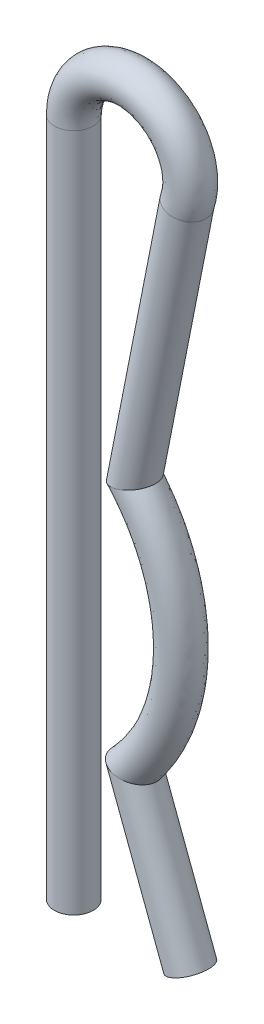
ISO-10303-21;
HEADER;
FILE_DESCRIPTION(('STEP AP214'),'2;1');
FILE_NAME('part.step','',(''),(''),'','','');
FILE_SCHEMA(('AUTOMOTIVE_DESIGN { 1 0 10303 214 1 1 1 1 }'));
ENDSEC;
DATA;
#1=APPLICATION_CONTEXT('core data for automotive mechanical design processes');
#2=APPLICATION_PROTOCOL_DEFINITION('international standard','automotive_design',2000,#1);
#3=PRODUCT_CONTEXT('',#1,'mechanical');
#4=PRODUCT('Part','Part','',(#3));
#5=PRODUCT_RELATED_PRODUCT_CATEGORY('part','',(#4));
#6=PRODUCT_DEFINITION_FORMATION('','',#4);
#7=PRODUCT_DEFINITION_CONTEXT('part definition',#1,'design');
#8=PRODUCT_DEFINITION('design','',#6,#7);
#9=PRODUCT_DEFINITION_SHAPE('','',#8);
#10=(LENGTH_UNIT() NAMED_UNIT(*) SI_UNIT(.MILLI.,.METRE.));
#11=(NAMED_UNIT(*) PLANE_ANGLE_UNIT() SI_UNIT($,.RADIAN.));
#12=(NAMED_UNIT(*) SI_UNIT($,.STERADIAN.) SOLID_ANGLE_UNIT());
#13=UNCERTAINTY_MEASURE_WITH_UNIT(LENGTH_MEASURE(1.E-05),#10,'distance_accuracy_value','');
#14=(GEOMETRIC_REPRESENTATION_CONTEXT(3) GLOBAL_UNCERTAINTY_ASSIGNED_CONTEXT((#13)) GLOBAL_UNIT_ASSIGNED_CONTEXT((#10,
#11,#12)) REPRESENTATION_CONTEXT('',''));
#15=CARTESIAN_POINT('',(0.,0.,0.));
#16=DIRECTION('',(0.,0.,1.));
#17=DIRECTION('',(1.,0.,0.));
#18=AXIS2_PLACEMENT_3D('',#15,#16,#17);
#19=CARTESIAN_POINT('',(7.62,0.,0.));
#20=DIRECTION('',(-0.352350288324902,0.935868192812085,0.));
#21=DIRECTION('',(-0.935868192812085,-0.352350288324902,0.));
#22=AXIS2_PLACEMENT_3D('',#19,#20,#21);
#23=PLANE('',#22);
#24=CARTESIAN_POINT('',(7.62,0.,0.));
#25=DIRECTION('',(-0.352350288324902,0.935868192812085,0.));
#26=DIRECTION('',(-0.935868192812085,-0.352350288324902,0.));
#27=AXIS2_PLACEMENT_3D('',#24,#25,#26);
#28=CIRCLE('',#27,1.27);
#29=CARTESIAN_POINT('',(6.43144739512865,-0.447484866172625,0.));
#30=VERTEX_POINT('',#29);
#31=EDGE_CURVE('E52',#30,#30,#28,.T.);
#32=ORIENTED_EDGE('',*,*,#31,.F.);
#33=EDGE_LOOP('',(#32));
#34=FACE_BOUND('',#33,.T.);
#35=ADVANCED_FACE('F49',(#34),#23,.F.);
#36=CARTESIAN_POINT('',(0.,0.,0.));
#37=DIRECTION('',(0.,-1.,0.));
#38=DIRECTION('',(1.,0.,0.));
#39=AXIS2_PLACEMENT_3D('',#36,#37,#38);
#40=PLANE('',#39);
#41=CARTESIAN_POINT('',(0.,0.,0.));
#42=DIRECTION('',(0.,-1.,0.));
#43=DIRECTION('',(1.,0.,0.));
#44=AXIS2_PLACEMENT_3D('',#41,#42,#43);
#45=CIRCLE('',#44,1.27);
#46=CARTESIAN_POINT('',(1.27,0.,0.));
#47=VERTEX_POINT('',#46);
#48=EDGE_CURVE('E153',#47,#47,#45,.T.);
#49=ORIENTED_EDGE('',*,*,#48,.T.);
#50=EDGE_LOOP('',(#49));
#51=FACE_BOUND('',#50,.T.);
#52=ADVANCED_FACE('F108',(#51),#40,.T.);
#53=CARTESIAN_POINT('',(3.66878385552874,10.4947197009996,0.));
#54=DIRECTION('',(0.352350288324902,-0.935868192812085,0.));
#55=DIRECTION('',(0.935868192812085,0.352350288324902,0.));
#56=AXIS2_PLACEMENT_3D('',#53,#54,#55);
#57=CYLINDRICAL_SURFACE('',#56,1.27);
#58=CARTESIAN_POINT('',(3.99528925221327,9.62749743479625,-1.27));
#59=CARTESIAN_POINT('',(3.99778830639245,9.62705756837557,-1.27000001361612));
#60=CARTESIAN_POINT('',(4.00028754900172,9.62661787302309,-1.26999438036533));
#61=CARTESIAN_POINT('',(4.10931716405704,9.60744502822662,-1.26950223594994));
#62=CARTESIAN_POINT('',(4.21613589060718,9.58903127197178,-1.25875961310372));
#63=CARTESIAN_POINT('',(4.4261069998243,9.5535347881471,-1.21639823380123));
#64=CARTESIAN_POINT('',(4.52924624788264,9.53645661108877,-1.18471131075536));
#65=CARTESIAN_POINT('',(4.71317724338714,9.50653413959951,-1.10628750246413));
#66=CARTESIAN_POINT('',(4.79507933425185,9.49343156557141,-1.06226678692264));
#67=CARTESIAN_POINT('',(4.94900831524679,9.46912908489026,-0.959146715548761));
#68=CARTESIAN_POINT('',(5.02105456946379,9.45792543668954,-0.900077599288));
#69=CARTESIAN_POINT('',(5.14355458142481,9.43907517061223,-0.776068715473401));
#70=CARTESIAN_POINT('',(5.19556832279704,9.43116175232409,-0.712714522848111));
#71=CARTESIAN_POINT('',(5.28624992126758,9.41746015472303,-0.576860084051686));
#72=CARTESIAN_POINT('',(5.32493227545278,9.41166966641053,-0.504369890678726));
#73=CARTESIAN_POINT('',(5.38206539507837,9.40315237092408,-0.363621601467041));
#74=CARTESIAN_POINT('',(5.40261267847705,9.40010672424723,-0.296230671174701));
#75=CARTESIAN_POINT('',(5.43092418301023,9.39591598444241,-0.158766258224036));
#76=CARTESIAN_POINT('',(5.43869754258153,9.39476953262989,-0.0886947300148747));
#77=CARTESIAN_POINT('',(5.44091199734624,9.39444273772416,0.0450736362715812));
#78=CARTESIAN_POINT('',(5.43653219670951,9.39508851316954,0.108753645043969));
#79=CARTESIAN_POINT('',(5.41714006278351,9.39795554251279,0.234424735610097));
#80=CARTESIAN_POINT('',(5.40212919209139,9.40017657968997,0.296416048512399));
#81=CARTESIAN_POINT('',(5.36237067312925,9.40608545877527,0.416449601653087));
#82=CARTESIAN_POINT('',(5.33771529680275,9.40975940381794,0.474523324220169));
#83=CARTESIAN_POINT('',(5.27969841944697,9.41845607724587,0.586021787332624));
#84=CARTESIAN_POINT('',(5.24633480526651,9.42347913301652,0.639445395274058));
#85=CARTESIAN_POINT('',(5.16964667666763,9.43510954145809,0.744004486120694));
#86=CARTESIAN_POINT('',(5.12580771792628,9.4417999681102,0.794752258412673));
#87=CARTESIAN_POINT('',(5.03114692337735,9.45637958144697,0.889013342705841));
#88=CARTESIAN_POINT('',(4.98032346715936,9.4642690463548,0.932524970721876));
#89=CARTESIAN_POINT('',(4.86701035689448,9.48204146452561,1.01639556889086));
#90=CARTESIAN_POINT('',(4.80385123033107,9.49204924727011,1.05582255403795));
#91=CARTESIAN_POINT('',(4.67247508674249,9.51313282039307,1.12482953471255));
#92=CARTESIAN_POINT('',(4.6042515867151,9.52420998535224,1.15439663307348));
#93=CARTESIAN_POINT('',(4.44892168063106,9.54977605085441,1.20900526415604));
#94=CARTESIAN_POINT('',(4.36098414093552,9.56447662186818,1.23158718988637));
#95=CARTESIAN_POINT('',(4.18289923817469,9.59476813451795,1.2618569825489));
#96=CARTESIAN_POINT('',(4.09275709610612,9.61035707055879,1.26957712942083));
#97=CARTESIAN_POINT('',(4.00028757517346,9.6266178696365,1.26999437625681));
#98=CARTESIAN_POINT('',(3.99778833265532,9.62705756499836,1.27000000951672));
#99=CARTESIAN_POINT('',(3.99528925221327,9.62749743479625,1.27));
#100=B_SPLINE_CURVE_WITH_KNOTS('',3,(#58,#59,#60,#61,#62,#63,#64,#65,#66,#67,#68,#69,#70,#71,
#72,#73,#74,#75,#76,#77,#78,#79,#80,#81,#82,#83,#84,#85,#86,#87,#88,#89,#90,#91,#92,#93,#94,#95,
#96,#97,#98,#99),.UNSPECIFIED.,.F.,.F.,(4,2,2,2,2,2,2,2,2,2,2,2,2,2,2,2,2,2,2,2,4),(0.,
0.0076128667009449,0.332090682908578,0.657629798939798,0.937755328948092,1.21732233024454,
1.4629178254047,1.70824540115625,1.91864016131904,2.12888433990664,2.31946194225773,
2.51001333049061,2.69878457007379,2.88760165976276,3.08896096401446,3.29036706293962,
3.51484271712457,3.73961085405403,4.01424881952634,4.28828959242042,4.29590245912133),.UNSPECIFIED.);
#101=CARTESIAN_POINT('',(3.99528925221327,9.62749743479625,-1.27));
#102=VERTEX_POINT('',#101);
#103=CARTESIAN_POINT('',(3.99528925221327,9.62749743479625,1.27));
#104=VERTEX_POINT('',#103);
#105=EDGE_CURVE('E78',#102,#104,#100,.T.);
#106=ORIENTED_EDGE('',*,*,#105,.T.);
#107=CARTESIAN_POINT('',(3.99528925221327,9.62749743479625,-1.27));
#108=CARTESIAN_POINT('',(3.99279024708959,9.62793728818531,-1.2700000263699));
#109=CARTESIAN_POINT('',(3.99029103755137,9.62837717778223,-1.26999439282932));
#110=CARTESIAN_POINT('',(3.88132191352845,9.64755700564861,-1.26950204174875));
#111=CARTESIAN_POINT('',(3.77454076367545,9.66635213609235,-1.25875142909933));
#112=CARTESIAN_POINT('',(3.6174852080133,9.69399675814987,-1.22724553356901));
#113=CARTESIAN_POINT('',(3.56554716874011,9.70313886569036,-1.21413651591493));
#114=CARTESIAN_POINT('',(3.46312797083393,9.72116674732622,-1.1827494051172));
#115=CARTESIAN_POINT('',(3.41264840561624,9.7300522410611,-1.16446587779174));
#116=CARTESIAN_POINT('',(3.27737154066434,9.75386399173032,-1.10736880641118));
#117=CARTESIAN_POINT('',(3.19463567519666,9.76842746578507,-1.06334525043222));
#118=CARTESIAN_POINT('',(3.0388532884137,9.79584894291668,-0.960032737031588));
#119=CARTESIAN_POINT('',(2.96580729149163,9.80870685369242,-0.900742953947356));
#120=CARTESIAN_POINT('',(2.85054713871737,9.82899551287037,-0.785180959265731));
#121=CARTESIAN_POINT('',(2.80524049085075,9.83697061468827,-0.732076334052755));
#122=CARTESIAN_POINT('',(2.7240174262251,9.85126789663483,-0.619064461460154));
#123=CARTESIAN_POINT('',(2.68807644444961,9.85759440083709,-0.559175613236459));
#124=CARTESIAN_POINT('',(2.62697112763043,9.86835044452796,-0.433463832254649));
#125=CARTESIAN_POINT('',(2.60187585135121,9.87276782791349,-0.367606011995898));
#126=CARTESIAN_POINT('',(2.56424474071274,9.87939182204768,-0.232280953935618));
#127=CARTESIAN_POINT('',(2.55170278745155,9.88159950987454,-0.162815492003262));
#128=CARTESIAN_POINT('',(2.5405138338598,9.88356903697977,-0.0294035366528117));
#129=CARTESIAN_POINT('',(2.54066094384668,9.88354314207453,0.0344409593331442));
#130=CARTESIAN_POINT('',(2.55185854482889,9.88157209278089,0.161123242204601));
#131=CARTESIAN_POINT('',(2.56290672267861,9.87962734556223,0.223961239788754));
#132=CARTESIAN_POINT('',(2.5948554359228,9.87400359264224,0.345037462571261));
#133=CARTESIAN_POINT('',(2.61546408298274,9.87037596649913,0.403355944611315));
#134=CARTESIAN_POINT('',(2.66548337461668,9.8615713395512,0.515941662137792));
#135=CARTESIAN_POINT('',(2.69489526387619,9.85639411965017,0.570208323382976));
#136=CARTESIAN_POINT('',(2.76340845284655,9.84433409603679,0.676802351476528));
#137=CARTESIAN_POINT('',(2.80299142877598,9.83736650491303,0.728809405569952));
#138=CARTESIAN_POINT('',(2.88938962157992,9.82215826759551,0.826323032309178));
#139=CARTESIAN_POINT('',(2.93621858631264,9.81391520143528,0.871816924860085));
#140=CARTESIAN_POINT('',(3.04967482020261,9.7939440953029,0.967509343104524));
#141=CARTESIAN_POINT('',(3.11816725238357,9.78188774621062,1.01543603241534));
#142=CARTESIAN_POINT('',(3.26203544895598,9.75656351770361,1.09911401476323));
#143=CARTESIAN_POINT('',(3.33741858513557,9.74329434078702,1.13485207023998));
#144=CARTESIAN_POINT('',(3.4930845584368,9.71589373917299,1.19408576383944));
#145=CARTESIAN_POINT('',(3.57338907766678,9.70175849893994,1.21752211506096));
#146=CARTESIAN_POINT('',(3.7364104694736,9.67306373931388,1.25182926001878));
#147=CARTESIAN_POINT('',(3.81912203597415,9.65850515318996,1.26272582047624));
#148=CARTESIAN_POINT('',(3.93063438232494,9.63887746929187,1.2689892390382));
#149=CARTESIAN_POINT('',(3.95921122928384,9.63384758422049,1.26985430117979));
#150=CARTESIAN_POINT('',(3.990290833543,9.62837721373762,1.26999436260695));
#151=CARTESIAN_POINT('',(3.99279003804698,9.6279373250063,1.26999999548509));
#152=CARTESIAN_POINT('',(3.99528925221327,9.62749743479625,1.27));
#153=B_SPLINE_CURVE_WITH_KNOTS('',3,(#107,#108,#109,#110,#111,#112,#113,#114,#115,#116,#117,
#118,#119,#120,#121,#122,#123,#124,#125,#126,#127,#128,#129,#130,#131,#132,#133,#134,#135,#136,
#137,#138,#139,#140,#141,#142,#143,#144,#145,#146,#147,#148,#149,#150,#151,#152),.UNSPECIFIED.,
.F.,.F.,(4,2,2,2,2,2,2,2,2,2,2,2,2,2,2,2,2,2,2,2,2,2,4),(0.,0.00761286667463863,
0.331909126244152,0.494741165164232,0.657744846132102,0.940616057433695,1.22350257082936,
1.4334089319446,1.64275906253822,1.85342324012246,2.06398468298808,2.25455997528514,
2.44509483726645,2.63016088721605,2.81525311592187,3.0116379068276,3.20839997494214,
3.4604672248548,3.71280736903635,3.96635272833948,4.21937616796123,4.30643641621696,
4.31404928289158),.UNSPECIFIED.);
#154=EDGE_CURVE('E80',#102,#104,#153,.T.);
#155=ORIENTED_EDGE('',*,*,#154,.F.);
#156=EDGE_LOOP('',(#106,#155));
#157=FACE_BOUND('',#156,.T.);
#158=ORIENTED_EDGE('',*,*,#31,.T.);
#159=EDGE_LOOP('',(#158));
#160=FACE_BOUND('',#159,.T.);
#161=ADVANCED_FACE('F86',(#157,#160),#57,.T.);
#162=CARTESIAN_POINT('',(2.52487499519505,25.658414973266,0.));
#163=CARTESIAN_POINT('',(2.69357481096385,25.4615701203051,0.));
#164=CARTESIAN_POINT('',(2.87084903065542,25.2547275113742,0.));
#165=CARTESIAN_POINT('',(3.25932036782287,24.8014281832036,0.));
#166=CARTESIAN_POINT('',(3.45183514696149,24.5541552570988,0.));
#167=CARTESIAN_POINT('',(3.83723951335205,24.0141735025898,0.));
#168=CARTESIAN_POINT('',(4.01790803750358,23.7357301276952,0.));
#169=CARTESIAN_POINT('',(4.5218824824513,22.8781104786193,0.));
#170=CARTESIAN_POINT('',(4.80705701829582,22.2765605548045,0.));
#171=CARTESIAN_POINT('',(5.49680944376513,20.4108852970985,0.));
#172=CARTESIAN_POINT('',(5.73370368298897,19.0869387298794,0.));
#173=CARTESIAN_POINT('',(5.73370368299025,16.4348754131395,0.));
#174=CARTESIAN_POINT('',(5.49680944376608,15.1109288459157,0.));
#175=CARTESIAN_POINT('',(4.80705701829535,13.2452535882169,0.));
#176=CARTESIAN_POINT('',(4.52188248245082,12.6437036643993,0.));
#177=CARTESIAN_POINT('',(4.01790803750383,11.7860840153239,0.));
#178=CARTESIAN_POINT('',(3.83723951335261,11.5076406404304,0.));
#179=CARTESIAN_POINT('',(3.45183514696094,10.9676588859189,0.));
#180=CARTESIAN_POINT('',(3.25932036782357,10.7203859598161,0.));
#181=CARTESIAN_POINT('',(2.84018875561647,10.2313097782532,0.));
#182=CARTESIAN_POINT('',(2.62897066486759,9.98486164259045,0.));
#183=CARTESIAN_POINT('',(2.42796877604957,9.75032559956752,0.));
#184=CARTESIAN_POINT('',(2.52487499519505,25.658414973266,2.54));
#185=CARTESIAN_POINT('',(2.69357481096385,25.4615701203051,2.54));
#186=CARTESIAN_POINT('',(2.87084903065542,25.2547275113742,2.54));
#187=CARTESIAN_POINT('',(3.25932036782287,24.8014281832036,2.54));
#188=CARTESIAN_POINT('',(3.45183514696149,24.5541552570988,2.54));
#189=CARTESIAN_POINT('',(3.83723951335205,24.0141735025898,2.54));
#190=CARTESIAN_POINT('',(4.01790803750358,23.7357301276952,2.54));
#191=CARTESIAN_POINT('',(4.5218824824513,22.8781104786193,2.54));
#192=CARTESIAN_POINT('',(4.80705701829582,22.2765605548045,2.54));
#193=CARTESIAN_POINT('',(5.49680944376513,20.4108852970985,2.54));
#194=CARTESIAN_POINT('',(5.73370368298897,19.0869387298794,2.54));
#195=CARTESIAN_POINT('',(5.73370368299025,16.4348754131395,2.54));
#196=CARTESIAN_POINT('',(5.49680944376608,15.1109288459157,2.54));
#197=CARTESIAN_POINT('',(4.80705701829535,13.2452535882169,2.54));
#198=CARTESIAN_POINT('',(4.52188248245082,12.6437036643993,2.54));
#199=CARTESIAN_POINT('',(4.01790803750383,11.7860840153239,2.54));
#200=CARTESIAN_POINT('',(3.83723951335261,11.5076406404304,2.54));
#201=CARTESIAN_POINT('',(3.45183514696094,10.9676588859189,2.54));
#202=CARTESIAN_POINT('',(3.25932036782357,10.7203859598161,2.54));
#203=CARTESIAN_POINT('',(2.84018875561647,10.2313097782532,2.54));
#204=CARTESIAN_POINT('',(2.62897066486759,9.98486164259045,2.54));
#205=CARTESIAN_POINT('',(2.42796877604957,9.75032559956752,2.54));
#206=CARTESIAN_POINT('',(4.45350461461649,27.3112875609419,2.54));
#207=CARTESIAN_POINT('',(4.62220443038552,27.114442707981,2.54));
#208=CARTESIAN_POINT('',(4.78233786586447,26.9276021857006,2.54));
#209=CARTESIAN_POINT('',(5.21239350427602,26.425776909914,2.54));
#210=CARTESIAN_POINT('',(5.47566548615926,26.0908207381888,2.54));
#211=CARTESIAN_POINT('',(5.9482501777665,25.4286925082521,2.54));
#212=CARTESIAN_POINT('',(6.1697867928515,25.0872638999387,2.54));
#213=CARTESIAN_POINT('',(6.78776268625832,24.0356465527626,2.54));
#214=CARTESIAN_POINT('',(7.13744507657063,23.2980231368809,2.54));
#215=CARTESIAN_POINT('',(7.9832228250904,21.0103231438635,2.54));
#216=CARTESIAN_POINT('',(8.27370368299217,19.3868934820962,2.54));
#217=CARTESIAN_POINT('',(8.27370368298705,16.1349206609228,2.54));
#218=CARTESIAN_POINT('',(7.98322282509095,14.5114909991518,2.54));
#219=CARTESIAN_POINT('',(7.13744507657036,12.2237910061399,2.54));
#220=CARTESIAN_POINT('',(6.78776268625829,11.486167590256,2.54));
#221=CARTESIAN_POINT('',(6.16978679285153,10.4345502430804,2.54));
#222=CARTESIAN_POINT('',(5.94825017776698,10.0931216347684,2.54));
#223=CARTESIAN_POINT('',(5.47566548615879,9.4309934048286,2.54));
#224=CARTESIAN_POINT('',(5.21239350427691,9.0960372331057,2.54));
#225=CARTESIAN_POINT('',(4.74839553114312,8.55460517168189,2.54));
#226=CARTESIAN_POINT('',(4.55760028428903,8.33198905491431,2.54));
#227=CARTESIAN_POINT('',(4.35659839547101,8.09745301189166,2.54));
#228=CARTESIAN_POINT('',(4.45350461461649,27.3112875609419,0.));
#229=CARTESIAN_POINT('',(4.62220443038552,27.114442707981,0.));
#230=CARTESIAN_POINT('',(4.78233786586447,26.9276021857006,0.));
#231=CARTESIAN_POINT('',(5.21239350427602,26.425776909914,0.));
#232=CARTESIAN_POINT('',(5.47566548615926,26.0908207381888,0.));
#233=CARTESIAN_POINT('',(5.94825017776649,25.4286925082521,0.));
#234=CARTESIAN_POINT('',(6.1697867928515,25.0872638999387,0.));
#235=CARTESIAN_POINT('',(6.78776268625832,24.0356465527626,0.));
#236=CARTESIAN_POINT('',(7.13744507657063,23.2980231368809,0.));
#237=CARTESIAN_POINT('',(7.9832228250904,21.0103231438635,0.));
#238=CARTESIAN_POINT('',(8.27370368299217,19.3868934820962,0.));
#239=CARTESIAN_POINT('',(8.27370368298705,16.1349206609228,0.));
#240=CARTESIAN_POINT('',(7.98322282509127,14.5114909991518,0.));
#241=CARTESIAN_POINT('',(7.1374450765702,12.2237910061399,0.));
#242=CARTESIAN_POINT('',(6.78776268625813,11.486167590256,0.));
#243=CARTESIAN_POINT('',(6.16978679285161,10.4345502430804,0.));
#244=CARTESIAN_POINT('',(5.94825017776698,10.0931216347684,0.));
#245=CARTESIAN_POINT('',(5.47566548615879,9.4309934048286,0.));
#246=CARTESIAN_POINT('',(5.21239350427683,9.0960372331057,0.));
#247=CARTESIAN_POINT('',(4.74839553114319,8.55460517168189,0.));
#248=CARTESIAN_POINT('',(4.5576002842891,8.33198905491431,0.));
#249=CARTESIAN_POINT('',(4.35659839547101,8.09745301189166,0.));
#250=CARTESIAN_POINT('',(4.45350461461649,27.3112875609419,-2.54));
#251=CARTESIAN_POINT('',(4.62220443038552,27.114442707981,-2.54));
#252=CARTESIAN_POINT('',(4.78233786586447,26.9276021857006,-2.54));
#253=CARTESIAN_POINT('',(5.21239350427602,26.425776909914,-2.54));
#254=CARTESIAN_POINT('',(5.47566548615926,26.0908207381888,-2.54));
#255=CARTESIAN_POINT('',(5.9482501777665,25.4286925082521,-2.54));
#256=CARTESIAN_POINT('',(6.1697867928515,25.0872638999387,-2.54));
#257=CARTESIAN_POINT('',(6.78776268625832,24.0356465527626,-2.54));
#258=CARTESIAN_POINT('',(7.13744507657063,23.2980231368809,-2.54));
#259=CARTESIAN_POINT('',(7.9832228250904,21.0103231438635,-2.54));
#260=CARTESIAN_POINT('',(8.27370368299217,19.3868934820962,-2.54));
#261=CARTESIAN_POINT('',(8.27370368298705,16.1349206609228,-2.54));
#262=CARTESIAN_POINT('',(7.98322282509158,14.5114909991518,-2.54));
#263=CARTESIAN_POINT('',(7.13744507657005,12.2237910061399,-2.54));
#264=CARTESIAN_POINT('',(6.78776268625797,11.486167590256,-2.54));
#265=CARTESIAN_POINT('',(6.16978679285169,10.4345502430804,-2.54));
#266=CARTESIAN_POINT('',(5.94825017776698,10.0931216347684,-2.54));
#267=CARTESIAN_POINT('',(5.47566548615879,9.4309934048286,-2.54));
#268=CARTESIAN_POINT('',(5.21239350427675,9.0960372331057,-2.54));
#269=CARTESIAN_POINT('',(4.74839553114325,8.55460517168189,-2.54));
#270=CARTESIAN_POINT('',(4.55760028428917,8.33198905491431,-2.54));
#271=CARTESIAN_POINT('',(4.35659839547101,8.09745301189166,-2.54));
#272=CARTESIAN_POINT('',(2.52487499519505,25.658414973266,-2.54));
#273=CARTESIAN_POINT('',(2.69357481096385,25.4615701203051,-2.54));
#274=CARTESIAN_POINT('',(2.87084903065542,25.2547275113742,-2.54));
#275=CARTESIAN_POINT('',(3.25932036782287,24.8014281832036,-2.54));
#276=CARTESIAN_POINT('',(3.45183514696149,24.5541552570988,-2.54));
#277=CARTESIAN_POINT('',(3.83723951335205,24.0141735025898,-2.54));
#278=CARTESIAN_POINT('',(4.01790803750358,23.7357301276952,-2.54));
#279=CARTESIAN_POINT('',(4.5218824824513,22.8781104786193,-2.54));
#280=CARTESIAN_POINT('',(4.80705701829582,22.2765605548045,-2.54));
#281=CARTESIAN_POINT('',(5.49680944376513,20.4108852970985,-2.54));
#282=CARTESIAN_POINT('',(5.73370368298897,19.0869387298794,-2.54));
#283=CARTESIAN_POINT('',(5.73370368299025,16.4348754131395,-2.54));
#284=CARTESIAN_POINT('',(5.49680944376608,15.1109288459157,-2.54));
#285=CARTESIAN_POINT('',(4.80705701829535,13.2452535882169,-2.54));
#286=CARTESIAN_POINT('',(4.52188248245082,12.6437036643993,-2.54));
#287=CARTESIAN_POINT('',(4.01790803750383,11.7860840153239,-2.54));
#288=CARTESIAN_POINT('',(3.83723951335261,11.5076406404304,-2.54));
#289=CARTESIAN_POINT('',(3.45183514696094,10.9676588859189,-2.54));
#290=CARTESIAN_POINT('',(3.25932036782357,10.7203859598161,-2.54));
#291=CARTESIAN_POINT('',(2.84018875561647,10.2313097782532,-2.54));
#292=CARTESIAN_POINT('',(2.62897066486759,9.98486164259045,-2.54));
#293=CARTESIAN_POINT('',(2.42796877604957,9.75032559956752,-2.54));
#294=CARTESIAN_POINT('',(2.52487499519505,25.658414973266,0.));
#295=CARTESIAN_POINT('',(2.69357481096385,25.4615701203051,0.));
#296=CARTESIAN_POINT('',(2.87084903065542,25.2547275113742,0.));
#297=CARTESIAN_POINT('',(3.25932036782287,24.8014281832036,0.));
#298=CARTESIAN_POINT('',(3.45183514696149,24.5541552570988,0.));
#299=CARTESIAN_POINT('',(3.83723951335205,24.0141735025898,0.));
#300=CARTESIAN_POINT('',(4.01790803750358,23.7357301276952,0.));
#301=CARTESIAN_POINT('',(4.5218824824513,22.8781104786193,0.));
#302=CARTESIAN_POINT('',(4.80705701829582,22.2765605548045,0.));
#303=CARTESIAN_POINT('',(5.49680944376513,20.4108852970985,0.));
#304=CARTESIAN_POINT('',(5.73370368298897,19.0869387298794,0.));
#305=CARTESIAN_POINT('',(5.73370368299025,16.4348754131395,0.));
#306=CARTESIAN_POINT('',(5.49680944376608,15.1109288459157,0.));
#307=CARTESIAN_POINT('',(4.80705701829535,13.2452535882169,0.));
#308=CARTESIAN_POINT('',(4.52188248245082,12.6437036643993,0.));
#309=CARTESIAN_POINT('',(4.01790803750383,11.7860840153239,0.));
#310=CARTESIAN_POINT('',(3.83723951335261,11.5076406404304,0.));
#311=CARTESIAN_POINT('',(3.45183514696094,10.9676588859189,0.));
#312=CARTESIAN_POINT('',(3.25932036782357,10.7203859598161,0.));
#313=CARTESIAN_POINT('',(2.84018875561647,10.2313097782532,0.));
#314=CARTESIAN_POINT('',(2.62897066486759,9.98486164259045,0.));
#315=CARTESIAN_POINT('',(2.42796877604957,9.75032559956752,0.));
#316=(BOUNDED_SURFACE() B_SPLINE_SURFACE(3,3,((#162,#163,#164,#165,#166,#167,#168,#169,#170,
#171,#172,#173,#174,#175,#176,#177,#178,#179,#180,#181,#182,#183),(#184,#185,#186,#187,#188,
#189,#190,#191,#192,#193,#194,#195,#196,#197,#198,#199,#200,#201,#202,#203,#204,#205),(#206,
#207,#208,#209,#210,#211,#212,#213,#214,#215,#216,#217,#218,#219,#220,#221,#222,#223,#224,#225,
#226,#227),(#228,#229,#230,#231,#232,#233,#234,#235,#236,#237,#238,#239,#240,#241,#242,#243,
#244,#245,#246,#247,#248,#249),(#250,#251,#252,#253,#254,#255,#256,#257,#258,#259,#260,#261,
#262,#263,#264,#265,#266,#267,#268,#269,#270,#271),(#272,#273,#274,#275,#276,#277,#278,#279,
#280,#281,#282,#283,#284,#285,#286,#287,#288,#289,#290,#291,#292,#293),(#294,#295,#296,#297,
#298,#299,#300,#301,#302,#303,#304,#305,#306,#307,#308,#309,#310,#311,#312,#313,#314,#315)),
.UNSPECIFIED.,.T.,.F.,.F.) B_SPLINE_SURFACE_WITH_KNOTS((4,3,4),(4,2,2,2,2,2,2,2,2,2,4),(0.,0.5,
1.),(-0.0438275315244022,0.,0.0625,0.125,0.25,0.5,0.75,0.875,0.9375,1.,1.05221947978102),
.UNSPECIFIED.) GEOMETRIC_REPRESENTATION_ITEM() RATIONAL_B_SPLINE_SURFACE(((1.,1.,1.,1.,1.,1.,1.,
1.,1.,1.,1.,1.,1.,1.,1.,1.,1.,1.,1.,1.,1.,1.),(0.333333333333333,0.333333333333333,
0.333333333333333,0.333333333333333,0.333333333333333,0.333333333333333,0.333333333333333,
0.333333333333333,0.333333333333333,0.333333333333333,0.333333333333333,0.333333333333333,
0.333333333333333,0.333333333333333,0.333333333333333,0.333333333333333,0.333333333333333,
0.333333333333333,0.333333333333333,0.333333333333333,0.333333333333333,0.333333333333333),
(0.333333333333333,0.333333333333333,0.333333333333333,0.333333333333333,0.333333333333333,
0.333333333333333,0.333333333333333,0.333333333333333,0.333333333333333,0.333333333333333,
0.333333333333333,0.333333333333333,0.333333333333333,0.333333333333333,0.333333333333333,
0.333333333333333,0.333333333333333,0.333333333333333,0.333333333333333,0.333333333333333,
0.333333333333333,0.333333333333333),(1.,1.,1.,1.,1.,1.,1.,1.,1.,1.,1.,1.,1.,1.,1.,1.,1.,1.,1.,
1.,1.,1.),(0.333333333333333,0.333333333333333,0.333333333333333,0.333333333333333,
0.333333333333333,0.333333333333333,0.333333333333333,0.333333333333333,0.333333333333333,
0.333333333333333,0.333333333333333,0.333333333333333,0.333333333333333,0.333333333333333,
0.333333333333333,0.333333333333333,0.333333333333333,0.333333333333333,0.333333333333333,
0.333333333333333,0.333333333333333,0.333333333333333),(0.333333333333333,0.333333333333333,
0.333333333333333,0.333333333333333,0.333333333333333,0.333333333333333,0.333333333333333,
0.333333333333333,0.333333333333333,0.333333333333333,0.333333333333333,0.333333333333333,
0.333333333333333,0.333333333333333,0.333333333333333,0.333333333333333,0.333333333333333,
0.333333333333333,0.333333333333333,0.333333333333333,0.333333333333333,0.333333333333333),(1.,
1.,1.,1.,1.,1.,1.,1.,1.,1.,1.,1.,1.,1.,1.,1.,1.,1.,1.,1.,1.,1.))) REPRESENTATION_ITEM('') SURFACE());
#317=CARTESIAN_POINT('',(3.99528925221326,25.8943167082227,-1.27));
#318=CARTESIAN_POINT('',(3.99788190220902,25.8949977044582,-1.27000003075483));
#319=CARTESIAN_POINT('',(4.00047481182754,25.89567857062,-1.26999315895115));
#320=CARTESIAN_POINT('',(4.0857823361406,25.918072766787,-1.26954003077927));
#321=CARTESIAN_POINT('',(4.16871477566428,25.9396421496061,-1.26207809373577));
#322=CARTESIAN_POINT('',(4.29136317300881,25.9712514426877,-1.24035082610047));
#323=CARTESIAN_POINT('',(4.33201685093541,25.9816795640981,-1.23133013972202));
#324=CARTESIAN_POINT('',(4.41251639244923,26.0022366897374,-1.2097662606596));
#325=CARTESIAN_POINT('',(4.45236132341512,26.0123653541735,-1.19721922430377));
#326=CARTESIAN_POINT('',(4.57021296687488,26.0421935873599,-1.15429740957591));
#327=CARTESIAN_POINT('',(4.64651367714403,26.0613295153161,-1.11864592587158));
#328=CARTESIAN_POINT('',(4.79171100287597,26.09747025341,-1.03376377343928));
#329=CARTESIAN_POINT('',(4.86061319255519,26.1144766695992,-0.984543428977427));
#330=CARTESIAN_POINT('',(4.9542070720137,26.137434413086,-0.903122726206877));
#331=CARTESIAN_POINT('',(4.98294128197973,26.1444595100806,-0.875769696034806));
#332=CARTESIAN_POINT('',(5.03784381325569,26.1578459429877,-0.818502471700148));
#333=CARTESIAN_POINT('',(5.06401443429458,26.1642078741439,-0.788590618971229));
#334=CARTESIAN_POINT('',(5.13824816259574,26.1822105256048,-0.695247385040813));
#335=CARTESIAN_POINT('',(5.18210678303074,26.1927861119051,-0.628144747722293));
#336=CARTESIAN_POINT('',(5.25249867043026,26.209707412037,-0.49345758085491));
#337=CARTESIAN_POINT('',(5.28031723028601,26.216368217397,-0.426578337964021));
#338=CARTESIAN_POINT('',(5.32359030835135,26.2267134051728,-0.288709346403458));
#339=CARTESIAN_POINT('',(5.33905215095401,26.2303995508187,-0.217722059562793));
#340=CARTESIAN_POINT('',(5.35613187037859,26.2344703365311,-0.0796713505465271));
#341=CARTESIAN_POINT('',(5.35873800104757,26.2350906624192,-0.0127353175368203));
#342=CARTESIAN_POINT('',(5.35267475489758,26.233646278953,0.120586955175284));
#343=CARTESIAN_POINT('',(5.34400766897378,26.2315821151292,0.186973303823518));
#344=CARTESIAN_POINT('',(5.3161391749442,26.2249319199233,0.315622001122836));
#345=CARTESIAN_POINT('',(5.29720367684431,26.2204095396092,0.377945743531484));
#346=CARTESIAN_POINT('',(5.24974698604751,26.2090428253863,0.498593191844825));
#347=CARTESIAN_POINT('',(5.22122475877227,26.2021982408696,0.55691646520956));
#348=CARTESIAN_POINT('',(5.15456224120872,26.1861404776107,0.670049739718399));
#349=CARTESIAN_POINT('',(5.11613613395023,26.1768567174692,0.724680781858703));
#350=CARTESIAN_POINT('',(5.03151678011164,26.1563144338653,0.827109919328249));
#351=CARTESIAN_POINT('',(4.98532201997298,26.1450555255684,0.8749066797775));
#352=CARTESIAN_POINT('',(4.88286364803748,26.1199439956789,0.96617102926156));
#353=CARTESIAN_POINT('',(4.82610465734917,26.1059601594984,1.00904485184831));
#354=CARTESIAN_POINT('',(4.70689946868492,26.0763904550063,1.08536215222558));
#355=CARTESIAN_POINT('',(4.64444972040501,26.0608035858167,1.1187996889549));
#356=CARTESIAN_POINT('',(4.54477910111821,26.0357415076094,1.16291483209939));
#357=CARTESIAN_POINT('',(4.50893500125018,26.0266937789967,1.17704335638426));
#358=CARTESIAN_POINT('',(4.4363304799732,26.0082914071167,1.20232398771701));
#359=CARTESIAN_POINT('',(4.39957090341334,25.9989370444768,1.21347873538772));
#360=CARTESIAN_POINT('',(4.28830373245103,25.9705013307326,1.24244000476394));
#361=CARTESIAN_POINT('',(4.21268093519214,25.9510155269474,1.25579910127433));
#362=CARTESIAN_POINT('',(4.09220095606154,25.9197003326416,1.26747899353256));
#363=CARTESIAN_POINT('',(4.0476276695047,25.9080567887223,1.26974329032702));
#364=CARTESIAN_POINT('',(4.00047498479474,25.8956786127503,1.26999312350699));
#365=CARTESIAN_POINT('',(3.99788207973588,25.8949977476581,1.26999999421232));
#366=CARTESIAN_POINT('',(3.99528925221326,25.8943167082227,1.27));
#367=B_SPLINE_CURVE_WITH_KNOTS('',3,(#317,#318,#319,#320,#321,#322,#323,#324,#325,#326,#327,
#328,#329,#330,#331,#332,#333,#334,#335,#336,#337,#338,#339,#340,#341,#342,#343,#344,#345,#346,
#347,#348,#349,#350,#351,#352,#353,#354,#355,#356,#357,#358,#359,#360,#361,#362,#363,#364,#365,
#366),.UNSPECIFIED.,.F.,.F.,(4,2,2,2,2,2,2,2,2,2,2,2,2,2,2,2,2,2,2,2,2,2,2,2,4),(0.,
0.00804241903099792,0.26457619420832,0.393248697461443,0.52206199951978,0.779759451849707,
1.03726136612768,1.15798066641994,1.27859066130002,1.51951831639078,1.7365957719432,
1.9535444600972,2.15352379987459,2.3534625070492,2.54845498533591,2.74346851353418,
2.944904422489,3.14637962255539,3.36296934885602,3.57969513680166,3.69831191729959,
3.81682301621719,4.05342370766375,4.19163228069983,4.1996746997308),.UNSPECIFIED.);
#368=CARTESIAN_POINT('',(3.99528925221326,25.8943167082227,-1.27));
#369=VERTEX_POINT('',#368);
#370=CARTESIAN_POINT('',(3.99528925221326,25.8943167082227,1.27));
#371=VERTEX_POINT('',#370);
#372=EDGE_CURVE('E84',#369,#371,#367,.T.);
#373=CARTESIAN_POINT('',(3.99528925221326,25.8943167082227,-1.27));
#374=CARTESIAN_POINT('',(3.99269654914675,25.8936357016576,-1.27000002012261));
#375=CARTESIAN_POINT('',(3.99010368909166,25.8929546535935,-1.26999314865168));
#376=CARTESIAN_POINT('',(3.90416273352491,25.8703811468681,-1.26953701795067));
#377=CARTESIAN_POINT('',(3.82069411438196,25.8484567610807,-1.26197501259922));
#378=CARTESIAN_POINT('',(3.655951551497,25.8051840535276,-1.2326273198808));
#379=CARTESIAN_POINT('',(3.57468459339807,25.7838375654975,-1.21080087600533));
#380=CARTESIAN_POINT('',(3.41678375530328,25.7423613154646,-1.15305221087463));
#381=CARTESIAN_POINT('',(3.34015713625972,25.7222334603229,-1.11710852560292));
#382=CARTESIAN_POINT('',(3.19439154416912,25.6839444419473,-1.03162720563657));
#383=CARTESIAN_POINT('',(3.1252457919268,25.6657814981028,-0.982102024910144));
#384=CARTESIAN_POINT('',(3.00109963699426,25.6331712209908,-0.873770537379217));
#385=CARTESIAN_POINT('',(2.94549770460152,25.6185658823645,-0.815703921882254));
#386=CARTESIAN_POINT('',(2.84587569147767,25.592397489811,-0.689751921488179));
#387=CARTESIAN_POINT('',(2.80184756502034,25.5808323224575,-0.621873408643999));
#388=CARTESIAN_POINT('',(2.73164454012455,25.5623916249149,-0.486006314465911));
#389=CARTESIAN_POINT('',(2.70407421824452,25.5551495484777,-0.418788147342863));
#390=CARTESIAN_POINT('',(2.66144917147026,25.5439529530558,-0.280241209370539));
#391=CARTESIAN_POINT('',(2.64638587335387,25.5399961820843,-0.208915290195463));
#392=CARTESIAN_POINT('',(2.63032069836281,25.5357762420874,-0.0709981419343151));
#393=CARTESIAN_POINT('',(2.62819497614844,25.535217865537,-0.004544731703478));
#394=CARTESIAN_POINT('',(2.63510225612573,25.5370322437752,0.127730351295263));
#395=CARTESIAN_POINT('',(2.64413291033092,25.5394043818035,0.193552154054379));
#396=CARTESIAN_POINT('',(2.67252953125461,25.5468635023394,0.320839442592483));
#397=CARTESIAN_POINT('',(2.69160458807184,25.5518740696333,0.382374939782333));
#398=CARTESIAN_POINT('',(2.73910908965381,25.564352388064,0.501441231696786));
#399=CARTESIAN_POINT('',(2.76753935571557,25.5718203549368,0.558971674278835));
#400=CARTESIAN_POINT('',(2.83396926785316,25.5892699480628,0.670891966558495));
#401=CARTESIAN_POINT('',(2.87229885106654,25.5993382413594,0.725071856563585));
#402=CARTESIAN_POINT('',(2.95657297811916,25.6214750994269,0.826670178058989));
#403=CARTESIAN_POINT('',(3.00252082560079,25.6335445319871,0.874085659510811));
#404=CARTESIAN_POINT('',(3.11029202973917,25.6618534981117,0.969978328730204));
#405=CARTESIAN_POINT('',(3.17346164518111,25.6784466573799,1.0168403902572));
#406=CARTESIAN_POINT('',(3.30651185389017,25.7133956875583,1.09904317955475));
#407=CARTESIAN_POINT('',(3.37639789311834,25.731752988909,1.13437445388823));
#408=CARTESIAN_POINT('',(3.48466211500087,25.7601911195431,1.17839822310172));
#409=CARTESIAN_POINT('',(3.52138803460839,25.7698380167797,1.19159202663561));
#410=CARTESIAN_POINT('',(3.59568959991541,25.7893549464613,1.21492906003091));
#411=CARTESIAN_POINT('',(3.63326431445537,25.799224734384,1.22507547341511));
#412=CARTESIAN_POINT('',(3.74685239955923,25.8290609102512,1.25089256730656));
#413=CARTESIAN_POINT('',(3.8239031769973,25.8492996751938,1.26201099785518));
#414=CARTESIAN_POINT('',(3.92995310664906,25.8771552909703,1.26882893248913));
#415=CARTESIAN_POINT('',(3.95872906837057,25.884713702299,1.26982694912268));
#416=CARTESIAN_POINT('',(3.99010352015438,25.8929546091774,1.26999311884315));
#417=CARTESIAN_POINT('',(3.99269637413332,25.8936356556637,1.26999998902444));
#418=CARTESIAN_POINT('',(3.99528925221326,25.8943167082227,1.27));
#419=B_SPLINE_CURVE_WITH_KNOTS('',3,(#373,#374,#375,#376,#377,#378,#379,#380,#381,#382,#383,
#384,#385,#386,#387,#388,#389,#390,#391,#392,#393,#394,#395,#396,#397,#398,#399,#400,#401,#402,
#403,#404,#405,#406,#407,#408,#409,#410,#411,#412,#413,#414,#415,#416,#417,#418),.UNSPECIFIED.,
.F.,.F.,(4,2,2,2,2,2,2,2,2,2,2,2,2,2,2,2,2,2,2,2,2,2,4),(0.,0.00804241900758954,
0.266555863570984,0.5258111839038,0.785462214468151,1.04487594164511,1.28864767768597,
1.53224950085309,1.75009573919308,1.96779252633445,2.16627301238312,2.36471173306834,
2.55769596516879,2.75069714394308,2.95122467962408,3.15183940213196,3.39179415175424,
3.63194513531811,3.75243063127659,3.87278981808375,4.11293669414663,4.20221212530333,
4.2102545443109),.UNSPECIFIED.);
#420=EDGE_CURVE('E154',#369,#371,#419,.T.);
#421=ORIENTED_EDGE('',*,*,#154,.T.);
#422=ORIENTED_EDGE('',*,*,#105,.F.);
#423=EDGE_LOOP('',(#421,#422));
#424=FACE_BOUND('',#423,.T.);
#425=ORIENTED_EDGE('',*,*,#372,.T.);
#426=ORIENTED_EDGE('',*,*,#420,.F.);
#427=EDGE_LOOP('',(#425,#426));
#428=FACE_BOUND('',#427,.T.);
#429=ADVANCED_FACE('F81',(#424,#428),#316,.F.);
#430=CARTESIAN_POINT('',(7.44985321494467,43.4020639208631,0.));
#431=DIRECTION('',(-0.193583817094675,-0.981083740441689,0.));
#432=DIRECTION('',(0.981083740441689,-0.193583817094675,0.));
#433=AXIS2_PLACEMENT_3D('',#430,#431,#432);
#434=CYLINDRICAL_SURFACE('',#433,1.27);
#435=ORIENTED_EDGE('',*,*,#420,.T.);
#436=ORIENTED_EDGE('',*,*,#372,.F.);
#437=EDGE_LOOP('',(#435,#436));
#438=FACE_BOUND('',#437,.T.);
#439=CARTESIAN_POINT('',(7.41113645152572,43.2058471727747,-1.27));
#440=CARTESIAN_POINT('',(7.40494830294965,43.2075178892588,-1.27000033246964));
#441=CARTESIAN_POINT('',(7.39875871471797,43.2091889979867,-1.26995198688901));
#442=CARTESIAN_POINT('',(7.32351129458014,43.229504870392,-1.26877365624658));
#443=CARTESIAN_POINT('',(7.2543864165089,43.2481681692,-1.26164511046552));
#444=CARTESIAN_POINT('',(7.15235691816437,43.2757160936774,-1.24204781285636));
#445=CARTESIAN_POINT('',(7.11857122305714,43.284838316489,-1.23401148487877));
#446=CARTESIAN_POINT('',(7.05174006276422,43.3028830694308,-1.21501315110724));
#447=CARTESIAN_POINT('',(7.01869519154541,43.3118054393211,-1.20404888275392));
#448=CARTESIAN_POINT('',(6.92120722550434,43.3381281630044,-1.16691924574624));
#449=CARTESIAN_POINT('',(6.85823275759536,43.3551321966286,-1.13648264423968));
#450=CARTESIAN_POINT('',(6.73812294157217,43.3875639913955,-1.06506397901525));
#451=CARTESIAN_POINT('',(6.68098780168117,43.4029916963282,-1.02408153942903));
#452=CARTESIAN_POINT('',(6.60094566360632,43.4246049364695,-0.955645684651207));
#453=CARTESIAN_POINT('',(6.57520623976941,43.4315552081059,-0.931670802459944));
#454=CARTESIAN_POINT('',(6.5257946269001,43.4448975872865,-0.881583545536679));
#455=CARTESIAN_POINT('',(6.50212046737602,43.4512902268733,-0.855473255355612));
#456=CARTESIAN_POINT('',(6.43440496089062,43.4695752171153,-0.774145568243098));
#457=CARTESIAN_POINT('',(6.39365467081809,43.4805789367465,-0.715917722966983));
#458=CARTESIAN_POINT('',(6.32231318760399,43.4998431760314,-0.593354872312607));
#459=CARTESIAN_POINT('',(6.29169864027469,43.5081100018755,-0.52903435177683));
#460=CARTESIAN_POINT('',(6.24134866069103,43.5217059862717,-0.39596810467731));
#461=CARTESIAN_POINT('',(6.22161288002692,43.5270352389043,-0.327222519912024));
#462=CARTESIAN_POINT('',(6.193627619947,43.5345921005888,-0.187417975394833));
#463=CARTESIAN_POINT('',(6.18535446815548,43.5368261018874,-0.116364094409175));
#464=CARTESIAN_POINT('',(6.18045359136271,43.5381494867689,0.0261730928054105));
#465=CARTESIAN_POINT('',(6.18382578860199,43.5372388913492,0.0976563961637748));
#466=CARTESIAN_POINT('',(6.20211192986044,43.5323010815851,0.238951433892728));
#467=CARTESIAN_POINT('',(6.21701454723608,43.5282769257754,0.308764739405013));
#468=CARTESIAN_POINT('',(6.25791115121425,43.5172336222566,0.444804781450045));
#469=CARTESIAN_POINT('',(6.28390529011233,43.5102144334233,0.511031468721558));
#470=CARTESIAN_POINT('',(6.34628807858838,43.4933692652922,0.638097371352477));
#471=CARTESIAN_POINT('',(6.3826828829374,43.4835416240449,0.698933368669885));
#472=CARTESIAN_POINT('',(6.44420758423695,43.4669282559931,0.784737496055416));
#473=CARTESIAN_POINT('',(6.46587528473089,43.461077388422,0.812434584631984));
#474=CARTESIAN_POINT('',(6.51139915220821,43.4487847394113,0.865875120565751));
#475=CARTESIAN_POINT('',(6.53525739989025,43.4423423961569,0.891616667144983));
#476=CARTESIAN_POINT('',(6.61002320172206,43.4221537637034,0.965760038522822));
#477=CARTESIAN_POINT('',(6.66400000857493,43.4075787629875,1.01091098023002));
#478=CARTESIAN_POINT('',(6.77851060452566,43.3766585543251,1.09117121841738));
#479=CARTESIAN_POINT('',(6.83904433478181,43.3603133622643,1.12628060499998));
#480=CARTESIAN_POINT('',(6.93345211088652,43.3348219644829,1.17069511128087));
#481=CARTESIAN_POINT('',(6.96556235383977,43.3261518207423,1.18413592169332));
#482=CARTESIAN_POINT('',(7.03072839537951,43.3085563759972,1.20816157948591));
#483=CARTESIAN_POINT('',(7.06378336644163,43.2996312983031,1.21874884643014));
#484=CARTESIAN_POINT('',(7.16395749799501,43.2725838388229,1.246086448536));
#485=CARTESIAN_POINT('',(7.23225552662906,43.2541434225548,1.25849219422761));
#486=CARTESIAN_POINT('',(7.33144521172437,43.2273628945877,1.26772383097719));
#487=CARTESIAN_POINT('',(7.36199867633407,43.2191137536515,1.26937810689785));
#488=CARTESIAN_POINT('',(7.39875738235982,43.2091893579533,1.26995160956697));
#489=CARTESIAN_POINT('',(7.40494685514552,43.2075182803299,1.2699999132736));
#490=CARTESIAN_POINT('',(7.41113645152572,43.2058471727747,1.27));
#491=B_SPLINE_CURVE_WITH_KNOTS('',3,(#439,#440,#441,#442,#443,#444,#445,#446,#447,#448,#449,
#450,#451,#452,#453,#454,#455,#456,#457,#458,#459,#460,#461,#462,#463,#464,#465,#466,#467,#468,
#469,#470,#471,#472,#473,#474,#475,#476,#477,#478,#479,#480,#481,#482,#483,#484,#485,#486,#487,
#488,#489,#490),.UNSPECIFIED.,.F.,.F.,(4,2,2,2,2,2,2,2,2,2,2,2,2,2,2,2,2,2,2,2,2,2,2,2,2,4),(0.,
0.0192332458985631,0.233799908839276,0.341424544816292,0.449132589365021,0.66399324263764,
0.878861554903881,0.986315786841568,1.09366634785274,1.308304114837,1.52244382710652,
1.73657668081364,1.95026664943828,2.16395519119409,2.37743408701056,2.59091591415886,
2.80452433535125,2.91136298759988,3.01830419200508,3.23281264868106,3.44731918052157,
3.55482493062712,3.66223923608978,3.87649605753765,3.97149971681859,3.99073296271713),.UNSPECIFIED.);
#492=CARTESIAN_POINT('',(7.41113645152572,43.2058471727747,-1.27));
#493=VERTEX_POINT('',#492);
#494=CARTESIAN_POINT('',(7.41113645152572,43.2058471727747,1.27));
#495=VERTEX_POINT('',#494);
#496=EDGE_CURVE('E12',#493,#495,#491,.T.);
#497=ORIENTED_EDGE('',*,*,#496,.F.);
#498=CARTESIAN_POINT('',(7.41113645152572,43.2058471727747,-1.27));
#499=CARTESIAN_POINT('',(7.41732459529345,43.2041764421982,-1.2700003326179));
#500=CARTESIAN_POINT('',(7.42351432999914,43.2025058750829,-1.26995198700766));
#501=CARTESIAN_POINT('',(7.4987261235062,43.1822139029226,-1.26877424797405));
#502=CARTESIAN_POINT('',(7.56783365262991,43.1636422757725,-1.26165293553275));
#503=CARTESIAN_POINT('',(7.66986541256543,43.1363306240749,-1.24207272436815));
#504=CARTESIAN_POINT('',(7.70365653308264,43.1273038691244,-1.23404317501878));
#505=CARTESIAN_POINT('',(7.77050711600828,43.1094798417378,-1.21506002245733));
#506=CARTESIAN_POINT('',(7.80356599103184,43.1006827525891,-1.20410415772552));
#507=CARTESIAN_POINT('',(7.9011082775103,43.074773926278,-1.16700113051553));
#508=CARTESIAN_POINT('',(7.96413428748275,43.0580973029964,-1.13658438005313));
#509=CARTESIAN_POINT('',(8.08436575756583,43.026381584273,-1.0652089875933));
#510=CARTESIAN_POINT('',(8.14157100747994,43.0113425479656,-1.02424996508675));
#511=CARTESIAN_POINT('',(8.22171852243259,42.9903236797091,-0.955857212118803));
#512=CARTESIAN_POINT('',(8.24749086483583,42.9835740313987,-0.931900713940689));
#513=CARTESIAN_POINT('',(8.29696987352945,42.970630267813,-0.881852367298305));
#514=CARTESIAN_POINT('',(8.32067850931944,42.964435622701,-0.855762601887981));
#515=CARTESIAN_POINT('',(8.38849857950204,42.9467327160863,-0.774499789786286));
#516=CARTESIAN_POINT('',(8.42931998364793,42.9361013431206,-0.716319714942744));
#517=CARTESIAN_POINT('',(8.50081580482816,42.9175055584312,-0.593835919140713));
#518=CARTESIAN_POINT('',(8.53150959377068,42.909536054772,-0.529544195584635));
#519=CARTESIAN_POINT('',(8.58200501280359,42.8964356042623,-0.396537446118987));
#520=CARTESIAN_POINT('',(8.60180695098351,42.8913045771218,-0.327822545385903));
#521=CARTESIAN_POINT('',(8.62991856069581,42.8840227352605,-0.188033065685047));
#522=CARTESIAN_POINT('',(8.63824459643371,42.8818676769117,-0.116961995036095));
#523=CARTESIAN_POINT('',(8.64322019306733,42.8805796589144,0.0256148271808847));
#524=CARTESIAN_POINT('',(8.63986980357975,42.8814466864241,0.0971205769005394));
#525=CARTESIAN_POINT('',(8.62159231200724,42.8861793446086,0.238491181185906));
#526=CARTESIAN_POINT('',(8.6066725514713,42.8900430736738,0.30835704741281));
#527=CARTESIAN_POINT('',(8.56570284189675,42.9006638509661,0.444504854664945));
#528=CARTESIAN_POINT('',(8.53965272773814,42.9074209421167,0.510786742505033));
#529=CARTESIAN_POINT('',(8.47712861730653,42.9236635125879,0.637948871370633));
#530=CARTESIAN_POINT('',(8.44065052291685,42.9331500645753,0.698826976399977));
#531=CARTESIAN_POINT('',(8.37898255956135,42.9492200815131,0.784690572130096));
#532=CARTESIAN_POINT('',(8.3572641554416,42.9548844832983,0.812406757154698));
#533=CARTESIAN_POINT('',(8.31163392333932,42.9667983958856,0.865883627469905));
#534=CARTESIAN_POINT('',(8.28772001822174,42.9730484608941,0.891642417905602));
#535=CARTESIAN_POINT('',(8.21293123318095,42.992619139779,0.965685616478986));
#536=CARTESIAN_POINT('',(8.15900621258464,43.0067610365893,1.01074111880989));
#537=CARTESIAN_POINT('',(8.044633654,43.0368496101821,1.09085860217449));
#538=CARTESIAN_POINT('',(7.98418617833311,43.0527962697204,1.12592067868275));
#539=CARTESIAN_POINT('',(7.88981392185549,43.0777833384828,1.17035995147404));
#540=CARTESIAN_POINT('',(7.85763585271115,43.0863178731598,1.1838425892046));
#541=CARTESIAN_POINT('',(7.79233619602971,43.1036698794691,1.20794371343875));
#542=CARTESIAN_POINT('',(7.75921542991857,43.1124871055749,1.21856461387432));
#543=CARTESIAN_POINT('',(7.65885046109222,43.1392590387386,1.24599039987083));
#544=CARTESIAN_POINT('',(7.59043371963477,43.1575789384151,1.25843814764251));
#545=CARTESIAN_POINT('',(7.4910339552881,43.1843032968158,1.26771297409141));
#546=CARTESIAN_POINT('',(7.46037582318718,43.1925606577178,1.26937654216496));
#547=CARTESIAN_POINT('',(7.42351566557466,43.2025055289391,1.26995160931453));
#548=CARTESIAN_POINT('',(7.41732604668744,43.204176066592,1.26999991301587));
#549=CARTESIAN_POINT('',(7.41113645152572,43.2058471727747,1.27));
#550=B_SPLINE_CURVE_WITH_KNOTS('',3,(#498,#499,#500,#501,#502,#503,#504,#505,#506,#507,#508,
#509,#510,#511,#512,#513,#514,#515,#516,#517,#518,#519,#520,#521,#522,#523,#524,#525,#526,#527,
#528,#529,#530,#531,#532,#533,#534,#535,#536,#537,#538,#539,#540,#541,#542,#543,#544,#545,#546,
#547,#548,#549),.UNSPECIFIED.,.F.,.F.,(4,2,2,2,2,2,2,2,2,2,2,2,2,2,2,2,2,2,2,2,2,2,2,2,2,4),(0.,
0.0192332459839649,0.233678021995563,0.341241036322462,0.448887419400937,0.663628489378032,
0.87837731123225,0.985750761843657,1.09302059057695,1.30749744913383,1.52156164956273,
1.73561979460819,1.94937238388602,2.16312406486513,2.37674021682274,2.59035953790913,
2.80406292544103,2.91094810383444,3.01793546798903,3.23189444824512,3.4458513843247,
3.55348816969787,3.66103387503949,3.87555335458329,3.97086687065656,3.99010011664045),.UNSPECIFIED.);
#551=EDGE_CURVE('E58',#493,#495,#550,.T.);
#552=ORIENTED_EDGE('',*,*,#551,.T.);
#553=EDGE_LOOP('',(#497,#552));
#554=FACE_BOUND('',#553,.T.);
#555=ADVANCED_FACE('F123',(#438,#554),#434,.T.);
#556=CARTESIAN_POINT('',(0.,0.,0.));
#557=DIRECTION('',(0.,1.,0.));
#558=DIRECTION('',(0.,0.,1.));
#559=AXIS2_PLACEMENT_3D('',#556,#557,#558);
#560=CYLINDRICAL_SURFACE('',#559,1.27);
#561=CARTESIAN_POINT('',(0.,44.45,0.));
#562=DIRECTION('',(0.,-1.,0.));
#563=DIRECTION('',(1.,0.,0.));
#564=AXIS2_PLACEMENT_3D('',#561,#562,#563);
#565=CIRCLE('',#564,1.27);
#566=CARTESIAN_POINT('',(1.27,44.45,0.));
#567=VERTEX_POINT('',#566);
#568=EDGE_CURVE('E150',#567,#567,#565,.T.);
#569=ORIENTED_EDGE('',*,*,#568,.T.);
#570=EDGE_LOOP('',(#569));
#571=FACE_BOUND('',#570,.T.);
#572=ORIENTED_EDGE('',*,*,#48,.F.);
#573=EDGE_LOOP('',(#572));
#574=FACE_BOUND('',#573,.T.);
#575=ADVANCED_FACE('F118',(#571,#574),#560,.T.);
#576=CARTESIAN_POINT('',(1.27,44.45,0.));
#577=CARTESIAN_POINT('',(1.27,44.5074516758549,0.));
#578=CARTESIAN_POINT('',(1.27124751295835,44.5418968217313,0.));
#579=CARTESIAN_POINT('',(1.27622907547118,44.6336140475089,0.));
#580=CARTESIAN_POINT('',(1.27996321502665,44.679395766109,0.));
#581=CARTESIAN_POINT('',(1.29488026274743,44.816342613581,0.));
#582=CARTESIAN_POINT('',(1.30978125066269,44.9071128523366,0.));
#583=CARTESIAN_POINT('',(1.36914039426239,45.1763526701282,0.));
#584=CARTESIAN_POINT('',(1.42833545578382,45.3517496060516,0.));
#585=CARTESIAN_POINT('',(1.66067036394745,45.8526744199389,0.));
#586=CARTESIAN_POINT('',(1.88865379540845,46.1515359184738,0.));
#587=CARTESIAN_POINT('',(2.73073686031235,46.8640368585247,0.));
#588=CARTESIAN_POINT('',(3.50528982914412,47.0766965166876,0.));
#589=CARTESIAN_POINT('',(4.95575191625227,46.8331985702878,0.));
#590=CARTESIAN_POINT('',(5.61840031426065,46.3792668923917,0.));
#591=CARTESIAN_POINT('',(6.18165361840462,45.4308438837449,0.));
#592=CARTESIAN_POINT('',(6.29933205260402,45.0745251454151,0.));
#593=CARTESIAN_POINT('',(6.35551563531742,44.5258391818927,0.));
#594=CARTESIAN_POINT('',(6.35431058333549,44.3408586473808,0.));
#595=CARTESIAN_POINT('',(6.32261104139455,44.0667992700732,0.));
#596=CARTESIAN_POINT('',(6.30707922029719,43.9760092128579,0.));
#597=CARTESIAN_POINT('',(6.2764366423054,43.8413882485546,0.));
#598=CARTESIAN_POINT('',(6.26499874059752,43.7967743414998,0.));
#599=CARTESIAN_POINT('',(6.23969479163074,43.7081740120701,0.));
#600=CARTESIAN_POINT('',(6.22959372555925,43.6750941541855,0.));
#601=CARTESIAN_POINT('',(6.19261880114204,43.5680539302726,0.));
#602=CARTESIAN_POINT('',(6.16721772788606,43.4945407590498,0.));
#603=CARTESIAN_POINT('',(6.14544777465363,43.431528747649,0.));
#604=CARTESIAN_POINT('',(1.27,44.45,2.54));
#605=CARTESIAN_POINT('',(1.27,44.5074516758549,2.54));
#606=CARTESIAN_POINT('',(1.27124751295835,44.5418968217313,2.54));
#607=CARTESIAN_POINT('',(1.27622907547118,44.6336140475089,2.54));
#608=CARTESIAN_POINT('',(1.27996321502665,44.679395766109,2.54));
#609=CARTESIAN_POINT('',(1.29488026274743,44.816342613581,2.54));
#610=CARTESIAN_POINT('',(1.30978125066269,44.9071128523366,2.54));
#611=CARTESIAN_POINT('',(1.36914039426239,45.1763526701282,2.54));
#612=CARTESIAN_POINT('',(1.42833545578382,45.3517496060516,2.54));
#613=CARTESIAN_POINT('',(1.66067036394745,45.8526744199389,2.54));
#614=CARTESIAN_POINT('',(1.88865379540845,46.1515359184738,2.54));
#615=CARTESIAN_POINT('',(2.73073686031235,46.8640368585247,2.54));
#616=CARTESIAN_POINT('',(3.50528982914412,47.0766965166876,2.54));
#617=CARTESIAN_POINT('',(4.95575191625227,46.8331985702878,2.54));
#618=CARTESIAN_POINT('',(5.61840031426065,46.3792668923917,2.54));
#619=CARTESIAN_POINT('',(6.18165361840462,45.4308438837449,2.54));
#620=CARTESIAN_POINT('',(6.29933205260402,45.0745251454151,2.54));
#621=CARTESIAN_POINT('',(6.35551563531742,44.5258391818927,2.54));
#622=CARTESIAN_POINT('',(6.35431058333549,44.3408586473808,2.54));
#623=CARTESIAN_POINT('',(6.32261104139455,44.0667992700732,2.54));
#624=CARTESIAN_POINT('',(6.30707922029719,43.9760092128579,2.54));
#625=CARTESIAN_POINT('',(6.2764366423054,43.8413882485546,2.54));
#626=CARTESIAN_POINT('',(6.26499874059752,43.7967743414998,2.54));
#627=CARTESIAN_POINT('',(6.23969479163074,43.7081740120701,2.54));
#628=CARTESIAN_POINT('',(6.22959372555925,43.6750941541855,2.54));
#629=CARTESIAN_POINT('',(6.19261880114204,43.5680539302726,2.54));
#630=CARTESIAN_POINT('',(6.16721772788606,43.4945407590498,2.54));
#631=CARTESIAN_POINT('',(6.14544777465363,43.431528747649,2.54));
#632=CARTESIAN_POINT('',(-1.27,44.45,2.54));
#633=CARTESIAN_POINT('',(-1.27,44.5304323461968,2.54));
#634=CARTESIAN_POINT('',(-1.26750497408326,44.6337936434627,2.54));
#635=CARTESIAN_POINT('',(-1.25754184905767,44.8172280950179,2.54));
#636=CARTESIAN_POINT('',(-1.25007356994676,44.9087915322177,2.54));
#637=CARTESIAN_POINT('',(-1.22023947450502,45.1826852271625,2.54));
#638=CARTESIAN_POINT('',(-1.19043749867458,45.3642257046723,2.54));
#639=CARTESIAN_POINT('',(-1.07171921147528,45.9027053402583,2.54));
#640=CARTESIAN_POINT('',(-0.953329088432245,46.2534992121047,2.54));
#641=CARTESIAN_POINT('',(-0.488659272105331,47.2553488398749,2.54));
#642=CARTESIAN_POINT('',(-0.0326924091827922,47.8530718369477,2.54));
#643=CARTESIAN_POINT('',(1.65147372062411,49.2780737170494,2.54));
#644=CARTESIAN_POINT('',(3.20057965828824,49.7033930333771,2.54));
#645=CARTESIAN_POINT('',(6.10150383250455,49.2163971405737,2.54));
#646=CARTESIAN_POINT('',(7.42680062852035,48.3085337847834,2.54));
#647=CARTESIAN_POINT('',(8.55330723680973,46.4116877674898,2.54));
#648=CARTESIAN_POINT('',(8.78866410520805,45.699050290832,2.54));
#649=CARTESIAN_POINT('',(8.90103127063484,44.6016783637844,2.54));
#650=CARTESIAN_POINT('',(8.89862116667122,44.2317172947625,2.54));
#651=CARTESIAN_POINT('',(8.83522208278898,43.683598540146,2.54));
#652=CARTESIAN_POINT('',(8.80415844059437,43.5020184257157,2.54));
#653=CARTESIAN_POINT('',(8.74287328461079,43.2327764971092,2.54));
#654=CARTESIAN_POINT('',(8.71999748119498,43.1435486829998,2.54));
#655=CARTESIAN_POINT('',(8.66938958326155,42.9663480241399,2.54));
#656=CARTESIAN_POINT('',(8.63788405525,42.8674712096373,2.54));
#657=CARTESIAN_POINT('',(8.58612257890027,42.7176138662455,2.54));
#658=CARTESIAN_POINT('',(8.56797536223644,42.6651055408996,2.54));
#659=CARTESIAN_POINT('',(8.54620540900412,42.6020935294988,2.54));
#660=CARTESIAN_POINT('',(-1.27,44.45,0.));
#661=CARTESIAN_POINT('',(-1.27,44.5304323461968,0.));
#662=CARTESIAN_POINT('',(-1.26750497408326,44.6337936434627,0.));
#663=CARTESIAN_POINT('',(-1.25754184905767,44.8172280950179,0.));
#664=CARTESIAN_POINT('',(-1.25007356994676,44.9087915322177,0.));
#665=CARTESIAN_POINT('',(-1.22023947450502,45.1826852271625,0.));
#666=CARTESIAN_POINT('',(-1.19043749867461,45.3642257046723,0.));
#667=CARTESIAN_POINT('',(-1.07171921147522,45.9027053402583,0.));
#668=CARTESIAN_POINT('',(-0.953329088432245,46.2534992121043,0.));
#669=CARTESIAN_POINT('',(-0.488659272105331,47.2553488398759,0.));
#670=CARTESIAN_POINT('',(-0.0326924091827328,47.8530718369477,0.));
#671=CARTESIAN_POINT('',(1.65147372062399,49.2780737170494,0.));
#672=CARTESIAN_POINT('',(3.20057965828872,49.703393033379,0.));
#673=CARTESIAN_POINT('',(6.10150383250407,49.2163971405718,0.));
#674=CARTESIAN_POINT('',(7.42680062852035,48.3085337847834,0.));
#675=CARTESIAN_POINT('',(8.55330723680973,46.4116877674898,0.));
#676=CARTESIAN_POINT('',(8.78866410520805,45.699050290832,0.));
#677=CARTESIAN_POINT('',(8.90103127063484,44.6016783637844,0.));
#678=CARTESIAN_POINT('',(8.89862116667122,44.2317172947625,0.));
#679=CARTESIAN_POINT('',(8.83522208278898,43.683598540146,0.));
#680=CARTESIAN_POINT('',(8.80415844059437,43.5020184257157,0.));
#681=CARTESIAN_POINT('',(8.74287328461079,43.2327764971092,0.));
#682=CARTESIAN_POINT('',(8.71999748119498,43.1435486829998,0.));
#683=CARTESIAN_POINT('',(8.66938958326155,42.9663480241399,0.));
#684=CARTESIAN_POINT('',(8.63788405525,42.8674712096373,0.));
#685=CARTESIAN_POINT('',(8.58612257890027,42.7176138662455,0.));
#686=CARTESIAN_POINT('',(8.56797536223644,42.6651055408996,0.));
#687=CARTESIAN_POINT('',(8.54620540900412,42.6020935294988,0.));
#688=CARTESIAN_POINT('',(-1.27,44.45,-2.54));
#689=CARTESIAN_POINT('',(-1.27,44.5304323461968,-2.54));
#690=CARTESIAN_POINT('',(-1.26750497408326,44.6337936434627,-2.54));
#691=CARTESIAN_POINT('',(-1.25754184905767,44.8172280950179,-2.54));
#692=CARTESIAN_POINT('',(-1.25007356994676,44.9087915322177,-2.54));
#693=CARTESIAN_POINT('',(-1.22023947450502,45.1826852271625,-2.54));
#694=CARTESIAN_POINT('',(-1.19043749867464,45.3642257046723,-2.54));
#695=CARTESIAN_POINT('',(-1.07171921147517,45.9027053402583,-2.54));
#696=CARTESIAN_POINT('',(-0.953329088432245,46.2534992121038,-2.54));
#697=CARTESIAN_POINT('',(-0.488659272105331,47.2553488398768,-2.54));
#698=CARTESIAN_POINT('',(-0.0326924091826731,47.8530718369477,-2.54));
#699=CARTESIAN_POINT('',(1.65147372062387,49.2780737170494,-2.54));
#700=CARTESIAN_POINT('',(3.2005796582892,49.7033930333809,-2.54));
#701=CARTESIAN_POINT('',(6.10150383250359,49.2163971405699,-2.54));
#702=CARTESIAN_POINT('',(7.42680062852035,48.3085337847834,-2.54));
#703=CARTESIAN_POINT('',(8.55330723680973,46.4116877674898,-2.54));
#704=CARTESIAN_POINT('',(8.78866410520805,45.699050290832,-2.54));
#705=CARTESIAN_POINT('',(8.90103127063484,44.6016783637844,-2.54));
#706=CARTESIAN_POINT('',(8.89862116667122,44.2317172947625,-2.54));
#707=CARTESIAN_POINT('',(8.83522208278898,43.683598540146,-2.54));
#708=CARTESIAN_POINT('',(8.80415844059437,43.5020184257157,-2.54));
#709=CARTESIAN_POINT('',(8.74287328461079,43.2327764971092,-2.54));
#710=CARTESIAN_POINT('',(8.71999748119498,43.1435486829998,-2.54));
#711=CARTESIAN_POINT('',(8.66938958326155,42.9663480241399,-2.54));
#712=CARTESIAN_POINT('',(8.63788405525,42.8674712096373,-2.54));
#713=CARTESIAN_POINT('',(8.58612257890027,42.7176138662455,-2.54));
#714=CARTESIAN_POINT('',(8.56797536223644,42.6651055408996,-2.54));
#715=CARTESIAN_POINT('',(8.54620540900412,42.6020935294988,-2.54));
#716=CARTESIAN_POINT('',(1.27,44.45,-2.54));
#717=CARTESIAN_POINT('',(1.27,44.5074516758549,-2.54));
#718=CARTESIAN_POINT('',(1.27124751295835,44.5418968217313,-2.54));
#719=CARTESIAN_POINT('',(1.27622907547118,44.6336140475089,-2.54));
#720=CARTESIAN_POINT('',(1.27996321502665,44.679395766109,-2.54));
#721=CARTESIAN_POINT('',(1.29488026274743,44.816342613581,-2.54));
#722=CARTESIAN_POINT('',(1.30978125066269,44.9071128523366,-2.54));
#723=CARTESIAN_POINT('',(1.36914039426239,45.1763526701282,-2.54));
#724=CARTESIAN_POINT('',(1.42833545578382,45.3517496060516,-2.54));
#725=CARTESIAN_POINT('',(1.66067036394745,45.8526744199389,-2.54));
#726=CARTESIAN_POINT('',(1.88865379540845,46.1515359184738,-2.54));
#727=CARTESIAN_POINT('',(2.73073686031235,46.8640368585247,-2.54));
#728=CARTESIAN_POINT('',(3.50528982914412,47.0766965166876,-2.54));
#729=CARTESIAN_POINT('',(4.95575191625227,46.8331985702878,-2.54));
#730=CARTESIAN_POINT('',(5.61840031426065,46.3792668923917,-2.54));
#731=CARTESIAN_POINT('',(6.18165361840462,45.4308438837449,-2.54));
#732=CARTESIAN_POINT('',(6.29933205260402,45.0745251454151,-2.54));
#733=CARTESIAN_POINT('',(6.35551563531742,44.5258391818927,-2.54));
#734=CARTESIAN_POINT('',(6.35431058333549,44.3408586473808,-2.54));
#735=CARTESIAN_POINT('',(6.32261104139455,44.0667992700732,-2.54));
#736=CARTESIAN_POINT('',(6.30707922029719,43.9760092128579,-2.54));
#737=CARTESIAN_POINT('',(6.2764366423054,43.8413882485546,-2.54));
#738=CARTESIAN_POINT('',(6.26499874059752,43.7967743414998,-2.54));
#739=CARTESIAN_POINT('',(6.23969479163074,43.7081740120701,-2.54));
#740=CARTESIAN_POINT('',(6.22959372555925,43.6750941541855,-2.54));
#741=CARTESIAN_POINT('',(6.19261880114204,43.5680539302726,-2.54));
#742=CARTESIAN_POINT('',(6.16721772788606,43.4945407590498,-2.54));
#743=CARTESIAN_POINT('',(6.14544777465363,43.431528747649,-2.54));
#744=CARTESIAN_POINT('',(1.27,44.45,0.));
#745=CARTESIAN_POINT('',(1.27,44.5074516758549,0.));
#746=CARTESIAN_POINT('',(1.27124751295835,44.5418968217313,0.));
#747=CARTESIAN_POINT('',(1.27622907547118,44.6336140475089,0.));
#748=CARTESIAN_POINT('',(1.27996321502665,44.679395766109,0.));
#749=CARTESIAN_POINT('',(1.29488026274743,44.816342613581,0.));
#750=CARTESIAN_POINT('',(1.30978125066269,44.9071128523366,0.));
#751=CARTESIAN_POINT('',(1.36914039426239,45.1763526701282,0.));
#752=CARTESIAN_POINT('',(1.42833545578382,45.3517496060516,0.));
#753=CARTESIAN_POINT('',(1.66067036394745,45.8526744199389,0.));
#754=CARTESIAN_POINT('',(1.88865379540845,46.1515359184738,0.));
#755=CARTESIAN_POINT('',(2.73073686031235,46.8640368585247,0.));
#756=CARTESIAN_POINT('',(3.50528982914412,47.0766965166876,0.));
#757=CARTESIAN_POINT('',(4.95575191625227,46.8331985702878,0.));
#758=CARTESIAN_POINT('',(5.61840031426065,46.3792668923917,0.));
#759=CARTESIAN_POINT('',(6.18165361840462,45.4308438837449,0.));
#760=CARTESIAN_POINT('',(6.29933205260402,45.0745251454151,0.));
#761=CARTESIAN_POINT('',(6.35551563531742,44.5258391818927,0.));
#762=CARTESIAN_POINT('',(6.35431058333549,44.3408586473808,0.));
#763=CARTESIAN_POINT('',(6.32261104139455,44.0667992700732,0.));
#764=CARTESIAN_POINT('',(6.30707922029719,43.9760092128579,0.));
#765=CARTESIAN_POINT('',(6.2764366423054,43.8413882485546,0.));
#766=CARTESIAN_POINT('',(6.26499874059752,43.7967743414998,0.));
#767=CARTESIAN_POINT('',(6.23969479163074,43.7081740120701,0.));
#768=CARTESIAN_POINT('',(6.22959372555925,43.6750941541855,0.));
#769=CARTESIAN_POINT('',(6.19261880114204,43.5680539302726,0.));
#770=CARTESIAN_POINT('',(6.16721772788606,43.4945407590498,0.));
#771=CARTESIAN_POINT('',(6.14544777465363,43.431528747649,0.));
#772=(BOUNDED_SURFACE() B_SPLINE_SURFACE(3,3,((#576,#577,#578,#579,#580,#581,#582,#583,#584,
#585,#586,#587,#588,#589,#590,#591,#592,#593,#594,#595,#596,#597,#598,#599,#600,#601,#602,#603),
(#604,#605,#606,#607,#608,#609,#610,#611,#612,#613,#614,#615,#616,#617,#618,#619,#620,#621,#622,
#623,#624,#625,#626,#627,#628,#629,#630,#631),(#632,#633,#634,#635,#636,#637,#638,#639,#640,
#641,#642,#643,#644,#645,#646,#647,#648,#649,#650,#651,#652,#653,#654,#655,#656,#657,#658,#659),
(#660,#661,#662,#663,#664,#665,#666,#667,#668,#669,#670,#671,#672,#673,#674,#675,#676,#677,#678,
#679,#680,#681,#682,#683,#684,#685,#686,#687),(#688,#689,#690,#691,#692,#693,#694,#695,#696,
#697,#698,#699,#700,#701,#702,#703,#704,#705,#706,#707,#708,#709,#710,#711,#712,#713,#714,#715),
(#716,#717,#718,#719,#720,#721,#722,#723,#724,#725,#726,#727,#728,#729,#730,#731,#732,#733,#734,
#735,#736,#737,#738,#739,#740,#741,#742,#743),(#744,#745,#746,#747,#748,#749,#750,#751,#752,
#753,#754,#755,#756,#757,#758,#759,#760,#761,#762,#763,#764,#765,#766,#767,#768,#769,#770,
#771)),.UNSPECIFIED.,.T.,.F.,.F.) B_SPLINE_SURFACE_WITH_KNOTS((4,3,4),(4,2,2,2,2,2,2,2,2,2,2,2,
2,4),(0.,0.5,1.),(0.770539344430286,0.774124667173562,0.777709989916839,0.784880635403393,
0.7992219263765,0.827904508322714,0.885269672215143,0.942634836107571,0.971317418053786,
0.985658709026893,0.992829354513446,0.996414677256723,1.,1.00345260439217),
.UNSPECIFIED.) GEOMETRIC_REPRESENTATION_ITEM() RATIONAL_B_SPLINE_SURFACE(((1.,1.,1.,1.,1.,1.,1.,
1.,1.,1.,1.,1.,1.,1.,1.,1.,1.,1.,1.,1.,1.,1.,1.,1.,1.,1.,1.,1.),(0.333333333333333,
0.333333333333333,0.333333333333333,0.333333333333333,0.333333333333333,0.333333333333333,
0.333333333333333,0.333333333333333,0.333333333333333,0.333333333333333,0.333333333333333,
0.333333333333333,0.333333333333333,0.333333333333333,0.333333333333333,0.333333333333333,
0.333333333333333,0.333333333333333,0.333333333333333,0.333333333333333,0.333333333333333,
0.333333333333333,0.333333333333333,0.333333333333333,0.333333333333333,0.333333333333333,
0.333333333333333,0.333333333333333),(0.333333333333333,0.333333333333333,0.333333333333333,
0.333333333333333,0.333333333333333,0.333333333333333,0.333333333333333,0.333333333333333,
0.333333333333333,0.333333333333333,0.333333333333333,0.333333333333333,0.333333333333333,
0.333333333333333,0.333333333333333,0.333333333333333,0.333333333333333,0.333333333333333,
0.333333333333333,0.333333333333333,0.333333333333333,0.333333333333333,0.333333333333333,
0.333333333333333,0.333333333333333,0.333333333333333,0.333333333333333,0.333333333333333),(1.,
1.,1.,1.,1.,1.,1.,1.,1.,1.,1.,1.,1.,1.,1.,1.,1.,1.,1.,1.,1.,1.,1.,1.,1.,1.,1.,1.),
(0.333333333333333,0.333333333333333,0.333333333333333,0.333333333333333,0.333333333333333,
0.333333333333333,0.333333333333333,0.333333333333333,0.333333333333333,0.333333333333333,
0.333333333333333,0.333333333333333,0.333333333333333,0.333333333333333,0.333333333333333,
0.333333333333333,0.333333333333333,0.333333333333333,0.333333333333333,0.333333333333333,
0.333333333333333,0.333333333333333,0.333333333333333,0.333333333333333,0.333333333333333,
0.333333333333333,0.333333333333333,0.333333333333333),(0.333333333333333,0.333333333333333,
0.333333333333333,0.333333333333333,0.333333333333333,0.333333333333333,0.333333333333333,
0.333333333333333,0.333333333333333,0.333333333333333,0.333333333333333,0.333333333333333,
0.333333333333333,0.333333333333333,0.333333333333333,0.333333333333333,0.333333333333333,
0.333333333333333,0.333333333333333,0.333333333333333,0.333333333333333,0.333333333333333,
0.333333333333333,0.333333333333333,0.333333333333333,0.333333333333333,0.333333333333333,
0.333333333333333),(1.,1.,1.,1.,1.,1.,1.,1.,1.,1.,1.,1.,1.,1.,1.,1.,1.,1.,1.,1.,1.,1.,1.,1.,1.,
1.,1.,1.))) REPRESENTATION_ITEM('') SURFACE());
#773=ORIENTED_EDGE('',*,*,#496,.T.);
#774=ORIENTED_EDGE('',*,*,#551,.F.);
#775=EDGE_LOOP('',(#773,#774));
#776=FACE_BOUND('',#775,.T.);
#777=ORIENTED_EDGE('',*,*,#568,.F.);
#778=EDGE_LOOP('',(#777));
#779=FACE_BOUND('',#778,.T.);
#780=ADVANCED_FACE('F116',(#776,#779),#772,.F.);
#781=CLOSED_SHELL('',(#35,#52,#161,#429,#555,#575,#780));
#782=MANIFOLD_SOLID_BREP('B2',#781);
#783=ADVANCED_BREP_SHAPE_REPRESENTATION('',(#18,#782),#14);
#784=SHAPE_DEFINITION_REPRESENTATION(#9,#783);
ENDSEC;
END-ISO-10303-21;
